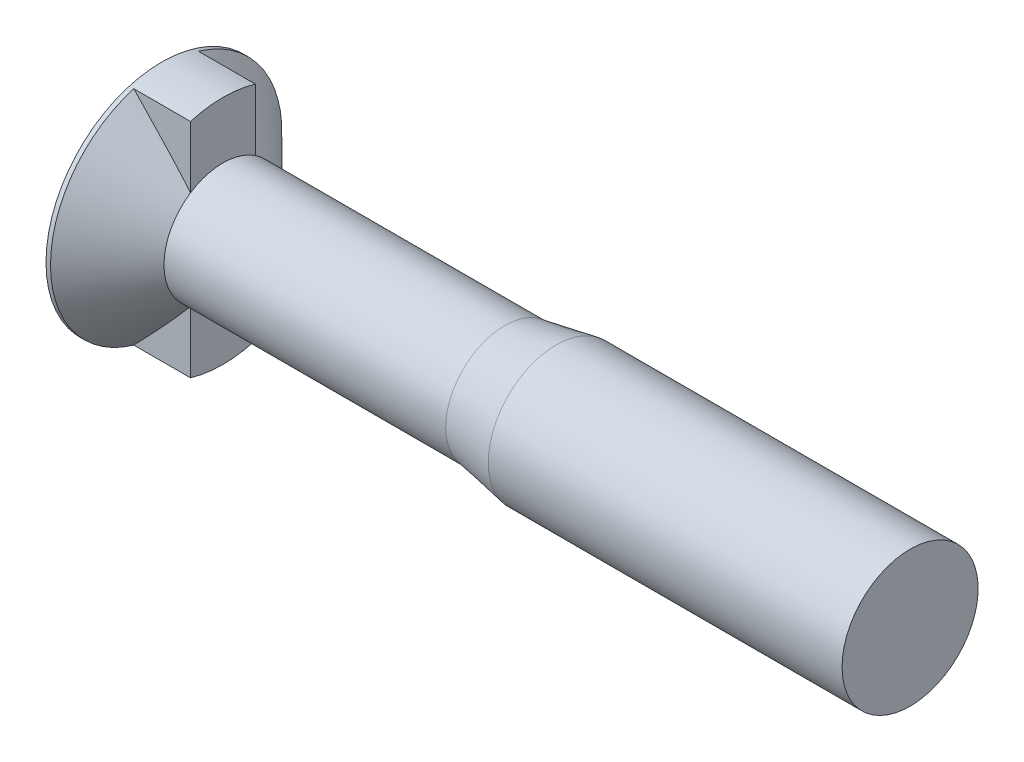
ISO-10303-21;
HEADER;
FILE_DESCRIPTION(('STEP AP214'),'2;1');
FILE_NAME('part.step','',(''),(''),'','','');
FILE_SCHEMA(('AUTOMOTIVE_DESIGN { 1 0 10303 214 1 1 1 1 }'));
ENDSEC;
DATA;
#1=APPLICATION_CONTEXT('core data for automotive mechanical design processes');
#2=APPLICATION_PROTOCOL_DEFINITION('international standard','automotive_design',2000,#1);
#3=PRODUCT_CONTEXT('',#1,'mechanical');
#4=PRODUCT('Part','Part','',(#3));
#5=PRODUCT_RELATED_PRODUCT_CATEGORY('part','',(#4));
#6=PRODUCT_DEFINITION_FORMATION('','',#4);
#7=PRODUCT_DEFINITION_CONTEXT('part definition',#1,'design');
#8=PRODUCT_DEFINITION('design','',#6,#7);
#9=PRODUCT_DEFINITION_SHAPE('','',#8);
#10=(LENGTH_UNIT() NAMED_UNIT(*) SI_UNIT(.MILLI.,.METRE.));
#11=(NAMED_UNIT(*) PLANE_ANGLE_UNIT() SI_UNIT($,.RADIAN.));
#12=(NAMED_UNIT(*) SI_UNIT($,.STERADIAN.) SOLID_ANGLE_UNIT());
#13=UNCERTAINTY_MEASURE_WITH_UNIT(LENGTH_MEASURE(1.E-05),#10,'distance_accuracy_value','');
#14=(GEOMETRIC_REPRESENTATION_CONTEXT(3) GLOBAL_UNCERTAINTY_ASSIGNED_CONTEXT((#13)) GLOBAL_UNIT_ASSIGNED_CONTEXT((#10,
#11,#12)) REPRESENTATION_CONTEXT('',''));
#15=CARTESIAN_POINT('',(0.,0.,0.));
#16=DIRECTION('',(0.,0.,1.));
#17=DIRECTION('',(1.,0.,0.));
#18=AXIS2_PLACEMENT_3D('',#15,#16,#17);
#19=CARTESIAN_POINT('',(0.,0.,0.));
#20=DIRECTION('',(1.,0.,0.));
#21=DIRECTION('',(0.,0.,-1.));
#22=AXIS2_PLACEMENT_3D('',#19,#20,#21);
#23=PLANE('',#22);
#24=CARTESIAN_POINT('',(0.,0.,0.));
#25=DIRECTION('',(-1.,0.,0.));
#26=DIRECTION('',(0.,0.,1.));
#27=AXIS2_PLACEMENT_3D('',#24,#25,#26);
#28=CIRCLE('',#27,8.5);
#29=CARTESIAN_POINT('',(0.,0.,8.5));
#30=VERTEX_POINT('',#29);
#31=EDGE_CURVE('E183',#30,#30,#28,.T.);
#32=ORIENTED_EDGE('',*,*,#31,.T.);
#33=EDGE_LOOP('',(#32));
#34=FACE_BOUND('',#33,.T.);
#35=ADVANCED_FACE('F50',(#34),#23,.F.);
#36=CARTESIAN_POINT('',(0.,8.5,-2.38));
#37=DIRECTION('',(0.,0.,-1.));
#38=DIRECTION('',(-1.,0.,0.));
#39=AXIS2_PLACEMENT_3D('',#36,#37,#38);
#40=PLANE('',#39);
#41=CARTESIAN_POINT('',(-10.1726294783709,18.8529549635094,-2.38));
#42=CARTESIAN_POINT('',(-9.6092054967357,18.2850367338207,-2.38));
#43=CARTESIAN_POINT('',(-9.04596141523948,17.7169396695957,-2.38));
#44=CARTESIAN_POINT('',(-7.91985527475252,16.5800527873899,-2.38));
#45=CARTESIAN_POINT('',(-7.35699336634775,16.0112628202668,-2.38));
#46=CARTESIAN_POINT('',(-6.22887883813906,14.8698254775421,-2.38));
#47=CARTESIAN_POINT('',(-5.66363020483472,14.2971741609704,-2.38));
#48=CARTESIAN_POINT('',(-4.53431907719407,13.1510133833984,-2.38));
#49=CARTESIAN_POINT('',(-3.97025629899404,12.5775042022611,-2.38));
#50=CARTESIAN_POINT('',(-3.03724942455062,11.6263293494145,-2.38));
#51=CARTESIAN_POINT('',(-2.66786793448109,11.2490928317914,-2.38));
#52=CARTESIAN_POINT('',(-1.92998632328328,10.4937379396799,-2.38));
#53=CARTESIAN_POINT('',(-1.56148622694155,10.1156195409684,-2.38));
#54=CARTESIAN_POINT('',(-0.825369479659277,9.35783453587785,-2.38));
#55=CARTESIAN_POINT('',(-0.457753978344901,8.9781668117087,-2.38));
#56=CARTESIAN_POINT('',(0.275668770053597,8.21716306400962,-2.38));
#57=CARTESIAN_POINT('',(0.64147619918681,7.83582721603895,-2.38));
#58=CARTESIAN_POINT('',(1.36888609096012,7.07225438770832,-2.38));
#59=CARTESIAN_POINT('',(1.73049983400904,6.69002818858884,-2.38));
#60=CARTESIAN_POINT('',(2.26977755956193,6.11359862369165,-2.38));
#61=CARTESIAN_POINT('',(2.44904940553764,5.92090058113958,-2.38));
#62=CARTESIAN_POINT('',(2.80616129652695,5.53418944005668,-2.38));
#63=CARTESIAN_POINT('',(2.98400137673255,5.3401763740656,-2.38));
#64=CARTESIAN_POINT('',(3.33745954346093,4.95073902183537,-2.38));
#65=CARTESIAN_POINT('',(3.51308091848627,4.75531772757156,-2.38));
#66=CARTESIAN_POINT('',(3.86164672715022,4.36210942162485,-2.38));
#67=CARTESIAN_POINT('',(4.03459124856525,4.164322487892,-2.38));
#68=CARTESIAN_POINT('',(4.3765190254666,3.76554433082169,-2.38));
#69=CARTESIAN_POINT('',(4.54550471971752,3.56455521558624,-2.38));
#70=CARTESIAN_POINT('',(4.79449741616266,3.25943933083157,-2.38));
#71=CARTESIAN_POINT('',(4.87674005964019,3.15713814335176,-2.38));
#72=CARTESIAN_POINT('',(5.03931634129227,2.95103221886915,-2.38));
#73=CARTESIAN_POINT('',(5.11965009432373,2.84722757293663,-2.38));
#74=CARTESIAN_POINT('',(5.2236259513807,2.70955522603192,-2.38));
#75=CARTESIAN_POINT('',(5.24837985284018,2.67652552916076,-2.38));
#76=CARTESIAN_POINT('',(5.29762112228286,2.61026669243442,-2.38));
#77=CARTESIAN_POINT('',(5.32210848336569,2.57703754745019,-2.38));
#78=CARTESIAN_POINT('',(5.39513720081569,2.47702782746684,-2.38));
#79=CARTESIAN_POINT('',(5.44324290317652,2.40992798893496,-2.38));
#80=CARTESIAN_POINT('',(5.53809377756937,2.2747072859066,-2.38));
#81=CARTESIAN_POINT('',(5.58483807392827,2.20658580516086,-2.38));
#82=CARTESIAN_POINT('',(5.67663447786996,2.06921412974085,-2.38));
#83=CARTESIAN_POINT('',(5.7216866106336,1.99996395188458,-2.38));
#84=CARTESIAN_POINT('',(5.85288854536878,1.79169325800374,-2.38));
#85=CARTESIAN_POINT('',(5.93606939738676,1.65077298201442,-2.38));
#86=CARTESIAN_POINT('',(6.09028702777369,1.36242824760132,-2.38));
#87=CARTESIAN_POINT('',(6.16133932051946,1.2150124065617,-2.38));
#88=CARTESIAN_POINT('',(6.2528595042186,0.990684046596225,-2.38));
#89=CARTESIAN_POINT('',(6.28049350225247,0.916704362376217,-2.38));
#90=CARTESIAN_POINT('',(6.33043185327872,0.766951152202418,-2.38));
#91=CARTESIAN_POINT('',(6.35273683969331,0.691177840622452,-2.38));
#92=CARTESIAN_POINT('',(6.39093323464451,0.538400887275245,-2.38));
#93=CARTESIAN_POINT('',(6.40685537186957,0.461405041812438,-2.38));
#94=CARTESIAN_POINT('',(6.43155420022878,0.306262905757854,-2.38));
#95=CARTESIAN_POINT('',(6.44033159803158,0.228116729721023,-2.38));
#96=CARTESIAN_POINT('',(6.45022100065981,0.0705765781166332,-2.38));
#97=CARTESIAN_POINT('',(6.45125857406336,-0.00882217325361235,-2.38));
#98=CARTESIAN_POINT('',(6.44539842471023,-0.167320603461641,-2.38));
#99=CARTESIAN_POINT('',(6.43850061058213,-0.246420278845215,-2.38));
#100=CARTESIAN_POINT('',(6.41720013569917,-0.403867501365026,-2.38));
#101=CARTESIAN_POINT('',(6.40277120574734,-0.482211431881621,-2.38));
#102=CARTESIAN_POINT('',(6.36725131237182,-0.637363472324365,-2.38));
#103=CARTESIAN_POINT('',(6.34615877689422,-0.714171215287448,-2.38));
#104=CARTESIAN_POINT('',(6.28595939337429,-0.905253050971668,-2.38));
#105=CARTESIAN_POINT('',(6.24317723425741,-1.01836422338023,-2.38));
#106=CARTESIAN_POINT('',(6.14798214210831,-1.24043752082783,-2.38));
#107=CARTESIAN_POINT('',(6.09556167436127,-1.34939631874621,-2.38));
#108=CARTESIAN_POINT('',(5.98347801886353,-1.56411852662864,-2.38));
#109=CARTESIAN_POINT('',(5.92378264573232,-1.6698649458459,-2.38));
#110=CARTESIAN_POINT('',(5.83039345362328,-1.82612085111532,-2.38));
#111=CARTESIAN_POINT('',(5.79862852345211,-1.87780346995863,-2.38));
#112=CARTESIAN_POINT('',(5.73398399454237,-1.98046493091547,-2.38));
#113=CARTESIAN_POINT('',(5.70110444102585,-2.03144380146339,-2.38));
#114=CARTESIAN_POINT('',(5.58801863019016,-2.20320274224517,-2.38));
#115=CARTESIAN_POINT('',(5.50556046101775,-2.32250103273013,-2.38));
#116=CARTESIAN_POINT('',(5.33673628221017,-2.55831016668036,-2.38));
#117=CARTESIAN_POINT('',(5.25036939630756,-2.67482037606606,-2.38));
#118=CARTESIAN_POINT('',(5.07469403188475,-2.90572142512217,-2.38));
#119=CARTESIAN_POINT('',(4.98538356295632,-3.0201107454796,-2.38));
#120=CARTESIAN_POINT('',(4.80457659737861,-3.24715248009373,-2.38));
#121=CARTESIAN_POINT('',(4.71307997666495,-3.35980479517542,-2.38));
#122=CARTESIAN_POINT('',(4.52818158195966,-3.58397838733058,-2.38));
#123=CARTESIAN_POINT('',(4.43477582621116,-3.69549637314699,-2.38));
#124=CARTESIAN_POINT('',(4.24662353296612,-3.91739677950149,-2.38));
#125=CARTESIAN_POINT('',(4.15187697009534,-4.02777917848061,-2.38));
#126=CARTESIAN_POINT('',(3.86612318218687,-4.35744551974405,-2.38));
#127=CARTESIAN_POINT('',(3.67352071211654,-4.57534597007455,-2.38));
#128=CARTESIAN_POINT('',(3.28485887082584,-5.00929063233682,-2.38));
#129=CARTESIAN_POINT('',(3.08879039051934,-5.22532664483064,-2.38));
#130=CARTESIAN_POINT('',(2.69461493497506,-5.6555685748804,-2.38));
#131=CARTESIAN_POINT('',(2.49650775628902,-5.86977430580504,-2.38));
#132=CARTESIAN_POINT('',(2.09911620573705,-6.29649459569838,-2.38));
#133=CARTESIAN_POINT('',(1.89983402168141,-6.50901119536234,-2.38));
#134=CARTESIAN_POINT('',(1.50016920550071,-6.93299320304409,-2.38));
#135=CARTESIAN_POINT('',(1.29978660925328,-7.14445864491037,-2.38));
#136=CARTESIAN_POINT('',(0.865817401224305,-7.60058061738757,-2.38));
#137=CARTESIAN_POINT('',(0.632082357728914,-7.84509584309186,-2.38));
#138=CARTESIAN_POINT('',(0.163737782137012,-8.33328768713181,-2.38));
#139=CARTESIAN_POINT('',(-0.0708717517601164,-8.57696430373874,-2.38));
#140=CARTESIAN_POINT('',(-0.775716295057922,-9.30702865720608,-2.38));
#141=CARTESIAN_POINT('',(-1.24695949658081,-9.79244278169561,-2.38));
#142=CARTESIAN_POINT('',(-2.1914508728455,-10.7619176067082,-2.38));
#143=CARTESIAN_POINT('',(-2.66470013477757,-11.245977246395,-2.38));
#144=CARTESIAN_POINT('',(-3.61236167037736,-12.2129497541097,-2.38));
#145=CARTESIAN_POINT('',(-4.08677393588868,-12.6958626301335,-2.38));
#146=CARTESIAN_POINT('',(-5.02821473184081,-13.652531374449,-2.38));
#147=CARTESIAN_POINT('',(-5.49522909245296,-14.1263011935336,-2.38));
#148=CARTESIAN_POINT('',(-6.42985007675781,-15.0732583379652,-2.38));
#149=CARTESIAN_POINT('',(-6.89745670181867,-15.5464456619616,-2.38));
#150=CARTESIAN_POINT('',(-7.83279377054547,-16.4920501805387,-2.38));
#151=CARTESIAN_POINT('',(-8.30052390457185,-16.9644676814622,-2.38));
#152=CARTESIAN_POINT('',(-9.236335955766,-17.9089513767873,-2.38));
#153=CARTESIAN_POINT('',(-9.70441787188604,-18.3810175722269,-2.38));
#154=CARTESIAN_POINT('',(-10.1726294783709,-18.8529549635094,-2.38));
#155=B_SPLINE_CURVE_WITH_KNOTS('',3,(#41,#42,#43,#44,#45,#46,#47,#48,#49,#50,#51,#52,#53,#54,
#55,#56,#57,#58,#59,#60,#61,#62,#63,#64,#65,#66,#67,#68,#69,#70,#71,#72,#73,#74,#75,#76,#77,#78,
#79,#80,#81,#82,#83,#84,#85,#86,#87,#88,#89,#90,#91,#92,#93,#94,#95,#96,#97,#98,#99,#100,#101,
#102,#103,#104,#105,#106,#107,#108,#109,#110,#111,#112,#113,#114,#115,#116,#117,#118,#119,#120,
#121,#122,#123,#124,#125,#126,#127,#128,#129,#130,#131,#132,#133,#134,#135,#136,#137,#138,#139,
#140,#141,#142,#143,#144,#145,#146,#147,#148,#149,#150,#151,#152,#153,#154),.UNSPECIFIED.,.F.,
.F.,(4,2,2,2,2,2,2,2,2,2,2,2,2,2,2,2,2,2,2,2,2,2,2,2,2,2,2,2,2,2,2,2,2,2,2,2,2,2,2,2,2,2,2,2,2,
2,2,2,2,2,2,2,2,2,2,2,4),(0.,2.39995853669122,4.80058720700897,7.21448779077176,
9.62772338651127,11.2116259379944,12.7955725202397,14.381001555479,15.9662675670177,
17.5447719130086,18.3343477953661,19.1239042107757,19.9121061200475,20.7002821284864,
21.4879590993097,21.8817259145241,22.2754689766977,22.39929620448,22.5231266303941,
22.7707988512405,23.0186270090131,23.2664514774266,23.7570210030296,24.2469582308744,
24.4837150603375,24.7204437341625,24.9560186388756,25.1915702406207,25.4293841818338,
25.6672008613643,25.9058526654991,26.1445608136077,26.5066990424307,26.8691215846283,
27.2332100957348,27.4151914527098,27.5971654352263,28.0321064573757,28.4671454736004,
28.9024849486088,29.3378491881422,29.7742394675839,30.21063801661,31.083054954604,
31.9582711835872,32.833575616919,33.7075788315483,34.581553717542,35.5963305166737,
36.6111094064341,38.640700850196,40.6715869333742,42.7024588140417,44.6982142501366,
46.6939743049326,48.6883531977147,50.6827261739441),.UNSPECIFIED.);
#156=CARTESIAN_POINT('',(0.329957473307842,8.16,-2.38));
#157=VERTEX_POINT('',#156);
#158=CARTESIAN_POINT('',(4.5,3.61719943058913,-2.38));
#159=VERTEX_POINT('',#158);
#160=EDGE_CURVE('E124',#157,#159,#155,.T.);
#161=ORIENTED_EDGE('',*,*,#160,.F.);
#162=DIRECTION('',(-1.,0.,0.));
#163=VECTOR('',#162,1.);
#164=CARTESIAN_POINT('',(55.,8.16,-2.38));
#165=LINE('',#164,#163);
#166=CARTESIAN_POINT('',(4.5,8.16,-2.38));
#167=VERTEX_POINT('',#166);
#168=EDGE_CURVE('E113',#157,#167,#165,.F.);
#169=ORIENTED_EDGE('',*,*,#168,.T.);
#170=DIRECTION('',(0.,1.,0.));
#171=VECTOR('',#170,1.);
#172=CARTESIAN_POINT('',(4.5,8.5,-2.38));
#173=LINE('',#172,#171);
#174=EDGE_CURVE('E134',#159,#167,#173,.T.);
#175=ORIENTED_EDGE('',*,*,#174,.F.);
#176=EDGE_LOOP('',(#161,#169,#175));
#177=FACE_BOUND('',#176,.T.);
#178=ADVANCED_FACE('F151',(#177),#40,.T.);
#179=CARTESIAN_POINT('',(0.,8.5,2.38));
#180=DIRECTION('',(0.,0.,-1.));
#181=DIRECTION('',(-1.,0.,0.));
#182=AXIS2_PLACEMENT_3D('',#179,#180,#181);
#183=PLANE('',#182);
#184=DIRECTION('',(-1.,0.,0.));
#185=VECTOR('',#184,1.);
#186=CARTESIAN_POINT('',(55.,8.16,2.38));
#187=LINE('',#186,#185);
#188=CARTESIAN_POINT('',(0.329957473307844,8.16,2.38));
#189=VERTEX_POINT('',#188);
#190=CARTESIAN_POINT('',(4.5,8.16,2.38));
#191=VERTEX_POINT('',#190);
#192=EDGE_CURVE('E119',#189,#191,#187,.F.);
#193=ORIENTED_EDGE('',*,*,#192,.F.);
#194=CARTESIAN_POINT('',(-10.1726294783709,18.8529549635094,2.38));
#195=CARTESIAN_POINT('',(-9.6092054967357,18.2850367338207,2.38));
#196=CARTESIAN_POINT('',(-9.04596141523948,17.7169396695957,2.38));
#197=CARTESIAN_POINT('',(-7.91985527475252,16.5800527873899,2.38));
#198=CARTESIAN_POINT('',(-7.35699336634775,16.0112628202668,2.38));
#199=CARTESIAN_POINT('',(-6.22887883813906,14.8698254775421,2.38));
#200=CARTESIAN_POINT('',(-5.66363020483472,14.2971741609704,2.38));
#201=CARTESIAN_POINT('',(-4.53431907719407,13.1510133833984,2.38));
#202=CARTESIAN_POINT('',(-3.97025629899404,12.5775042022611,2.38));
#203=CARTESIAN_POINT('',(-3.03724942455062,11.6263293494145,2.38));
#204=CARTESIAN_POINT('',(-2.66786793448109,11.2490928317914,2.38));
#205=CARTESIAN_POINT('',(-1.92998632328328,10.4937379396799,2.38));
#206=CARTESIAN_POINT('',(-1.56148622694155,10.1156195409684,2.38));
#207=CARTESIAN_POINT('',(-0.825369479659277,9.35783453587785,2.38));
#208=CARTESIAN_POINT('',(-0.457753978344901,8.9781668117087,2.38));
#209=CARTESIAN_POINT('',(0.275668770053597,8.21716306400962,2.38));
#210=CARTESIAN_POINT('',(0.64147619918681,7.83582721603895,2.38));
#211=CARTESIAN_POINT('',(1.36888609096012,7.07225438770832,2.38));
#212=CARTESIAN_POINT('',(1.73049983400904,6.69002818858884,2.38));
#213=CARTESIAN_POINT('',(2.26977755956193,6.11359862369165,2.38));
#214=CARTESIAN_POINT('',(2.44904940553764,5.92090058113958,2.38));
#215=CARTESIAN_POINT('',(2.80616129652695,5.53418944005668,2.38));
#216=CARTESIAN_POINT('',(2.98400137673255,5.3401763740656,2.38));
#217=CARTESIAN_POINT('',(3.33745954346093,4.95073902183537,2.38));
#218=CARTESIAN_POINT('',(3.51308091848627,4.75531772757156,2.38));
#219=CARTESIAN_POINT('',(3.86164672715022,4.36210942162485,2.38));
#220=CARTESIAN_POINT('',(4.03459124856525,4.164322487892,2.38));
#221=CARTESIAN_POINT('',(4.3765190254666,3.76554433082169,2.38));
#222=CARTESIAN_POINT('',(4.54550471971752,3.56455521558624,2.38));
#223=CARTESIAN_POINT('',(4.79449741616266,3.25943933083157,2.38));
#224=CARTESIAN_POINT('',(4.87674005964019,3.15713814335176,2.38));
#225=CARTESIAN_POINT('',(5.03931634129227,2.95103221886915,2.38));
#226=CARTESIAN_POINT('',(5.11965009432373,2.84722757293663,2.38));
#227=CARTESIAN_POINT('',(5.2236259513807,2.70955522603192,2.38));
#228=CARTESIAN_POINT('',(5.24837985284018,2.67652552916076,2.38));
#229=CARTESIAN_POINT('',(5.29762112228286,2.61026669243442,2.38));
#230=CARTESIAN_POINT('',(5.32210848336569,2.57703754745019,2.38));
#231=CARTESIAN_POINT('',(5.39513720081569,2.47702782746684,2.38));
#232=CARTESIAN_POINT('',(5.44324290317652,2.40992798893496,2.38));
#233=CARTESIAN_POINT('',(5.53809377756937,2.2747072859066,2.38));
#234=CARTESIAN_POINT('',(5.58483807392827,2.20658580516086,2.38));
#235=CARTESIAN_POINT('',(5.67663447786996,2.06921412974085,2.38));
#236=CARTESIAN_POINT('',(5.7216866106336,1.99996395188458,2.38));
#237=CARTESIAN_POINT('',(5.85288854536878,1.79169325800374,2.38));
#238=CARTESIAN_POINT('',(5.93606939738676,1.65077298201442,2.38));
#239=CARTESIAN_POINT('',(6.09028702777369,1.36242824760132,2.38));
#240=CARTESIAN_POINT('',(6.16133932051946,1.2150124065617,2.38));
#241=CARTESIAN_POINT('',(6.2528595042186,0.990684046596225,2.38));
#242=CARTESIAN_POINT('',(6.28049350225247,0.916704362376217,2.38));
#243=CARTESIAN_POINT('',(6.33043185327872,0.766951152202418,2.38));
#244=CARTESIAN_POINT('',(6.35273683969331,0.691177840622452,2.38));
#245=CARTESIAN_POINT('',(6.39093323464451,0.538400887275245,2.38));
#246=CARTESIAN_POINT('',(6.40685537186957,0.461405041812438,2.38));
#247=CARTESIAN_POINT('',(6.43155420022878,0.306262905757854,2.38));
#248=CARTESIAN_POINT('',(6.44033159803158,0.228116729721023,2.38));
#249=CARTESIAN_POINT('',(6.45022100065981,0.0705765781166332,2.38));
#250=CARTESIAN_POINT('',(6.45125857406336,-0.00882217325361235,2.38));
#251=CARTESIAN_POINT('',(6.44539842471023,-0.167320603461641,2.38));
#252=CARTESIAN_POINT('',(6.43850061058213,-0.246420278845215,2.38));
#253=CARTESIAN_POINT('',(6.41720013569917,-0.403867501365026,2.38));
#254=CARTESIAN_POINT('',(6.40277120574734,-0.482211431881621,2.38));
#255=CARTESIAN_POINT('',(6.36725131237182,-0.637363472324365,2.38));
#256=CARTESIAN_POINT('',(6.34615877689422,-0.714171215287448,2.38));
#257=CARTESIAN_POINT('',(6.28595939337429,-0.905253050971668,2.38));
#258=CARTESIAN_POINT('',(6.24317723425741,-1.01836422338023,2.38));
#259=CARTESIAN_POINT('',(6.14798214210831,-1.24043752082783,2.38));
#260=CARTESIAN_POINT('',(6.09556167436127,-1.34939631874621,2.38));
#261=CARTESIAN_POINT('',(5.98347801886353,-1.56411852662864,2.38));
#262=CARTESIAN_POINT('',(5.92378264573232,-1.6698649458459,2.38));
#263=CARTESIAN_POINT('',(5.83039345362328,-1.82612085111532,2.38));
#264=CARTESIAN_POINT('',(5.79862852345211,-1.87780346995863,2.38));
#265=CARTESIAN_POINT('',(5.73398399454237,-1.98046493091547,2.38));
#266=CARTESIAN_POINT('',(5.70110444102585,-2.03144380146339,2.38));
#267=CARTESIAN_POINT('',(5.58801863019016,-2.20320274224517,2.38));
#268=CARTESIAN_POINT('',(5.50556046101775,-2.32250103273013,2.38));
#269=CARTESIAN_POINT('',(5.33673628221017,-2.55831016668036,2.38));
#270=CARTESIAN_POINT('',(5.25036939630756,-2.67482037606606,2.38));
#271=CARTESIAN_POINT('',(5.07469403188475,-2.90572142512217,2.38));
#272=CARTESIAN_POINT('',(4.98538356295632,-3.0201107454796,2.38));
#273=CARTESIAN_POINT('',(4.80457659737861,-3.24715248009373,2.38));
#274=CARTESIAN_POINT('',(4.71307997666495,-3.35980479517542,2.38));
#275=CARTESIAN_POINT('',(4.52818158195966,-3.58397838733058,2.38));
#276=CARTESIAN_POINT('',(4.43477582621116,-3.69549637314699,2.38));
#277=CARTESIAN_POINT('',(4.24662353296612,-3.91739677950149,2.38));
#278=CARTESIAN_POINT('',(4.15187697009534,-4.02777917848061,2.38));
#279=CARTESIAN_POINT('',(3.86612318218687,-4.35744551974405,2.38));
#280=CARTESIAN_POINT('',(3.67352071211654,-4.57534597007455,2.38));
#281=CARTESIAN_POINT('',(3.28485887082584,-5.00929063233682,2.38));
#282=CARTESIAN_POINT('',(3.08879039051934,-5.22532664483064,2.38));
#283=CARTESIAN_POINT('',(2.69461493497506,-5.6555685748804,2.38));
#284=CARTESIAN_POINT('',(2.49650775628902,-5.86977430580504,2.38));
#285=CARTESIAN_POINT('',(2.09911620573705,-6.29649459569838,2.38));
#286=CARTESIAN_POINT('',(1.89983402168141,-6.50901119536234,2.38));
#287=CARTESIAN_POINT('',(1.50016920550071,-6.93299320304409,2.38));
#288=CARTESIAN_POINT('',(1.29978660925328,-7.14445864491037,2.38));
#289=CARTESIAN_POINT('',(0.865817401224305,-7.60058061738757,2.38));
#290=CARTESIAN_POINT('',(0.632082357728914,-7.84509584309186,2.38));
#291=CARTESIAN_POINT('',(0.163737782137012,-8.33328768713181,2.38));
#292=CARTESIAN_POINT('',(-0.0708717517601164,-8.57696430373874,2.38));
#293=CARTESIAN_POINT('',(-0.775716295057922,-9.30702865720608,2.38));
#294=CARTESIAN_POINT('',(-1.24695949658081,-9.79244278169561,2.38));
#295=CARTESIAN_POINT('',(-2.1914508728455,-10.7619176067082,2.38));
#296=CARTESIAN_POINT('',(-2.66470013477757,-11.245977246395,2.38));
#297=CARTESIAN_POINT('',(-3.61236167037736,-12.2129497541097,2.38));
#298=CARTESIAN_POINT('',(-4.08677393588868,-12.6958626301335,2.38));
#299=CARTESIAN_POINT('',(-5.02821473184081,-13.652531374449,2.38));
#300=CARTESIAN_POINT('',(-5.49522909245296,-14.1263011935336,2.38));
#301=CARTESIAN_POINT('',(-6.42985007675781,-15.0732583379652,2.38));
#302=CARTESIAN_POINT('',(-6.89745670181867,-15.5464456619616,2.38));
#303=CARTESIAN_POINT('',(-7.83279377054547,-16.4920501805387,2.38));
#304=CARTESIAN_POINT('',(-8.30052390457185,-16.9644676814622,2.38));
#305=CARTESIAN_POINT('',(-9.236335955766,-17.9089513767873,2.38));
#306=CARTESIAN_POINT('',(-9.70441787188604,-18.3810175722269,2.38));
#307=CARTESIAN_POINT('',(-10.1726294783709,-18.8529549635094,2.38));
#308=B_SPLINE_CURVE_WITH_KNOTS('',3,(#194,#195,#196,#197,#198,#199,#200,#201,#202,#203,#204,
#205,#206,#207,#208,#209,#210,#211,#212,#213,#214,#215,#216,#217,#218,#219,#220,#221,#222,#223,
#224,#225,#226,#227,#228,#229,#230,#231,#232,#233,#234,#235,#236,#237,#238,#239,#240,#241,#242,
#243,#244,#245,#246,#247,#248,#249,#250,#251,#252,#253,#254,#255,#256,#257,#258,#259,#260,#261,
#262,#263,#264,#265,#266,#267,#268,#269,#270,#271,#272,#273,#274,#275,#276,#277,#278,#279,#280,
#281,#282,#283,#284,#285,#286,#287,#288,#289,#290,#291,#292,#293,#294,#295,#296,#297,#298,#299,
#300,#301,#302,#303,#304,#305,#306,#307),.UNSPECIFIED.,.F.,.F.,(4,2,2,2,2,2,2,2,2,2,2,2,2,2,2,2,
2,2,2,2,2,2,2,2,2,2,2,2,2,2,2,2,2,2,2,2,2,2,2,2,2,2,2,2,2,2,2,2,2,2,2,2,2,2,2,2,4),(0.,
2.39995853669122,4.80058720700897,7.21448779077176,9.62772338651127,11.2116259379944,
12.7955725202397,14.381001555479,15.9662675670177,17.5447719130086,18.3343477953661,
19.1239042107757,19.9121061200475,20.7002821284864,21.4879590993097,21.8817259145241,
22.2754689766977,22.39929620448,22.5231266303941,22.7707988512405,23.0186270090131,
23.2664514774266,23.7570210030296,24.2469582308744,24.4837150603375,24.7204437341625,
24.9560186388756,25.1915702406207,25.4293841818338,25.6672008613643,25.9058526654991,
26.1445608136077,26.5066990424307,26.8691215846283,27.2332100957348,27.4151914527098,
27.5971654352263,28.0321064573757,28.4671454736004,28.9024849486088,29.3378491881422,
29.7742394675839,30.21063801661,31.083054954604,31.9582711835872,32.833575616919,
33.7075788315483,34.581553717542,35.5963305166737,36.6111094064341,38.640700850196,
40.6715869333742,42.7024588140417,44.6982142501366,46.6939743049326,48.6883531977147,
50.6827261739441),.UNSPECIFIED.);
#309=CARTESIAN_POINT('',(4.5,3.61719943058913,2.38));
#310=VERTEX_POINT('',#309);
#311=EDGE_CURVE('E65',#189,#310,#308,.T.);
#312=ORIENTED_EDGE('',*,*,#311,.T.);
#313=DIRECTION('',(0.,1.,0.));
#314=VECTOR('',#313,1.);
#315=CARTESIAN_POINT('',(4.5,8.5,2.38));
#316=LINE('',#315,#314);
#317=EDGE_CURVE('E125',#310,#191,#316,.T.);
#318=ORIENTED_EDGE('',*,*,#317,.T.);
#319=EDGE_LOOP('',(#193,#312,#318));
#320=FACE_BOUND('',#319,.T.);
#321=ADVANCED_FACE('F155',(#320),#183,.F.);
#322=CARTESIAN_POINT('',(4.5,8.5,2.38));
#323=DIRECTION('',(-1.,0.,0.));
#324=DIRECTION('',(0.,0.,1.));
#325=AXIS2_PLACEMENT_3D('',#322,#323,#324);
#326=PLANE('',#325);
#327=CARTESIAN_POINT('',(4.5,0.,0.));
#328=DIRECTION('',(-1.,0.,0.));
#329=DIRECTION('',(0.,0.,1.));
#330=AXIS2_PLACEMENT_3D('',#327,#328,#329);
#331=CIRCLE('',#330,8.5);
#332=EDGE_CURVE('E228',#191,#167,#331,.T.);
#333=ORIENTED_EDGE('',*,*,#332,.F.);
#334=ORIENTED_EDGE('',*,*,#317,.F.);
#335=CARTESIAN_POINT('',(4.5,0.,0.));
#336=DIRECTION('',(-1.,0.,0.));
#337=DIRECTION('',(0.,0.,1.));
#338=AXIS2_PLACEMENT_3D('',#335,#336,#337);
#339=CIRCLE('',#338,4.32995747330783);
#340=EDGE_CURVE('E58',#310,#159,#339,.T.);
#341=ORIENTED_EDGE('',*,*,#340,.T.);
#342=ORIENTED_EDGE('',*,*,#174,.T.);
#343=EDGE_LOOP('',(#333,#334,#341,#342));
#344=FACE_BOUND('',#343,.T.);
#345=ADVANCED_FACE('F159',(#344),#326,.F.);
#346=CARTESIAN_POINT('',(4.5,0.,0.));
#347=DIRECTION('',(-1.,0.,0.));
#348=DIRECTION('',(0.,0.,1.));
#349=AXIS2_PLACEMENT_3D('',#346,#347,#348);
#350=CIRCLE('',#349,8.5);
#351=CARTESIAN_POINT('',(4.5,-8.16,-2.38));
#352=VERTEX_POINT('',#351);
#353=CARTESIAN_POINT('',(4.5,-8.16,2.38));
#354=VERTEX_POINT('',#353);
#355=EDGE_CURVE('E105',#352,#354,#350,.T.);
#356=ORIENTED_EDGE('',*,*,#355,.F.);
#357=CARTESIAN_POINT('',(4.5,-3.61719943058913,-2.38));
#358=VERTEX_POINT('',#357);
#359=EDGE_CURVE('E130',#352,#358,#173,.T.);
#360=ORIENTED_EDGE('',*,*,#359,.T.);
#361=CARTESIAN_POINT('',(4.5,-3.61719943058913,2.38));
#362=VERTEX_POINT('',#361);
#363=EDGE_CURVE('E123',#358,#362,#339,.T.);
#364=ORIENTED_EDGE('',*,*,#363,.T.);
#365=EDGE_CURVE('E73',#354,#362,#316,.T.);
#366=ORIENTED_EDGE('',*,*,#365,.F.);
#367=EDGE_LOOP('',(#356,#360,#364,#366));
#368=FACE_BOUND('',#367,.T.);
#369=ADVANCED_FACE('F121',(#368),#326,.F.);
#370=DIRECTION('',(-1.,0.,0.));
#371=VECTOR('',#370,1.);
#372=CARTESIAN_POINT('',(55.,-8.16,2.38));
#373=LINE('',#372,#371);
#374=CARTESIAN_POINT('',(0.329957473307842,-8.16,2.38));
#375=VERTEX_POINT('',#374);
#376=EDGE_CURVE('E109',#354,#375,#373,.T.);
#377=ORIENTED_EDGE('',*,*,#376,.F.);
#378=ORIENTED_EDGE('',*,*,#365,.T.);
#379=EDGE_CURVE('E117',#362,#375,#308,.T.);
#380=ORIENTED_EDGE('',*,*,#379,.T.);
#381=EDGE_LOOP('',(#377,#378,#380));
#382=FACE_BOUND('',#381,.T.);
#383=ADVANCED_FACE('F115',(#382),#183,.F.);
#384=ORIENTED_EDGE('',*,*,#359,.F.);
#385=DIRECTION('',(-1.,0.,0.));
#386=VECTOR('',#385,1.);
#387=CARTESIAN_POINT('',(55.,-8.16,-2.38));
#388=LINE('',#387,#386);
#389=CARTESIAN_POINT('',(0.329957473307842,-8.16,-2.38));
#390=VERTEX_POINT('',#389);
#391=EDGE_CURVE('E110',#352,#390,#388,.T.);
#392=ORIENTED_EDGE('',*,*,#391,.T.);
#393=EDGE_CURVE('E128',#358,#390,#155,.T.);
#394=ORIENTED_EDGE('',*,*,#393,.F.);
#395=EDGE_LOOP('',(#384,#392,#394));
#396=FACE_BOUND('',#395,.T.);
#397=ADVANCED_FACE('F157',(#396),#40,.T.);
#398=CARTESIAN_POINT('',(4.5,0.,0.));
#399=DIRECTION('',(-1.,0.,0.));
#400=DIRECTION('',(0.,0.,1.));
#401=AXIS2_PLACEMENT_3D('',#398,#399,#400);
#402=CONICAL_SURFACE('',#401,4.32995747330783,0.78539816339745);
#403=ORIENTED_EDGE('',*,*,#311,.F.);
#404=CARTESIAN_POINT('',(0.329957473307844,0.,0.));
#405=DIRECTION('',(-1.,0.,0.));
#406=DIRECTION('',(0.,0.,1.));
#407=AXIS2_PLACEMENT_3D('',#404,#405,#406);
#408=CIRCLE('',#407,8.5);
#409=EDGE_CURVE('E184',#375,#189,#408,.T.);
#410=ORIENTED_EDGE('',*,*,#409,.F.);
#411=ORIENTED_EDGE('',*,*,#379,.F.);
#412=EDGE_CURVE('E193',#362,#310,#339,.T.);
#413=ORIENTED_EDGE('',*,*,#412,.T.);
#414=EDGE_LOOP('',(#403,#410,#411,#413));
#415=FACE_BOUND('',#414,.T.);
#416=ADVANCED_FACE('F180',(#415),#402,.T.);
#417=CARTESIAN_POINT('',(29.,0.,0.));
#418=DIRECTION('',(1.,0.,0.));
#419=DIRECTION('',(0.,0.,-1.));
#420=AXIS2_PLACEMENT_3D('',#417,#418,#419);
#421=CONICAL_SURFACE('',#420,5.,0.174532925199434);
#422=CARTESIAN_POINT('',(25.2,0.,0.));
#423=DIRECTION('',(-1.,0.,0.));
#424=DIRECTION('',(0.,0.,1.));
#425=AXIS2_PLACEMENT_3D('',#422,#423,#424);
#426=CIRCLE('',#425,4.32995747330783);
#427=CARTESIAN_POINT('',(25.2,0.,4.32995747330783));
#428=VERTEX_POINT('',#427);
#429=EDGE_CURVE('E13',#428,#428,#426,.T.);
#430=ORIENTED_EDGE('',*,*,#429,.F.);
#431=EDGE_LOOP('',(#430));
#432=FACE_BOUND('',#431,.T.);
#433=CARTESIAN_POINT('',(29.,0.,0.));
#434=DIRECTION('',(-1.,0.,0.));
#435=DIRECTION('',(0.,0.,1.));
#436=AXIS2_PLACEMENT_3D('',#433,#434,#435);
#437=CIRCLE('',#436,5.);
#438=CARTESIAN_POINT('',(29.,0.,5.));
#439=VERTEX_POINT('',#438);
#440=EDGE_CURVE('E190',#439,#439,#437,.T.);
#441=ORIENTED_EDGE('',*,*,#440,.T.);
#442=EDGE_LOOP('',(#441));
#443=FACE_BOUND('',#442,.T.);
#444=ADVANCED_FACE('F52',(#432,#443),#421,.T.);
#445=CARTESIAN_POINT('',(-4.94054877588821,0.,0.));
#446=DIRECTION('',(-1.,0.,0.));
#447=DIRECTION('',(0.,0.,1.));
#448=AXIS2_PLACEMENT_3D('',#445,#446,#447);
#449=CYLINDRICAL_SURFACE('',#448,4.32995747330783);
#450=ORIENTED_EDGE('',*,*,#340,.F.);
#451=ORIENTED_EDGE('',*,*,#412,.F.);
#452=ORIENTED_EDGE('',*,*,#363,.F.);
#453=EDGE_CURVE('E192',#159,#358,#339,.T.);
#454=ORIENTED_EDGE('',*,*,#453,.F.);
#455=EDGE_LOOP('',(#450,#451,#452,#454));
#456=FACE_BOUND('',#455,.T.);
#457=ORIENTED_EDGE('',*,*,#429,.T.);
#458=EDGE_LOOP('',(#457));
#459=FACE_BOUND('',#458,.T.);
#460=ADVANCED_FACE('F178',(#456,#459),#449,.T.);
#461=EDGE_CURVE('E187',#157,#390,#408,.T.);
#462=ORIENTED_EDGE('',*,*,#461,.F.);
#463=ORIENTED_EDGE('',*,*,#160,.T.);
#464=ORIENTED_EDGE('',*,*,#453,.T.);
#465=ORIENTED_EDGE('',*,*,#393,.T.);
#466=EDGE_LOOP('',(#462,#463,#464,#465));
#467=FACE_BOUND('',#466,.T.);
#468=ADVANCED_FACE('F148',(#467),#402,.T.);
#469=CARTESIAN_POINT('',(-4.94054877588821,0.,0.));
#470=DIRECTION('',(-1.,0.,0.));
#471=DIRECTION('',(0.,0.,1.));
#472=AXIS2_PLACEMENT_3D('',#469,#470,#471);
#473=CYLINDRICAL_SURFACE('',#472,8.5);
#474=ORIENTED_EDGE('',*,*,#31,.F.);
#475=EDGE_LOOP('',(#474));
#476=FACE_BOUND('',#475,.T.);
#477=ORIENTED_EDGE('',*,*,#461,.T.);
#478=ORIENTED_EDGE('',*,*,#391,.F.);
#479=ORIENTED_EDGE('',*,*,#355,.T.);
#480=ORIENTED_EDGE('',*,*,#376,.T.);
#481=ORIENTED_EDGE('',*,*,#409,.T.);
#482=ORIENTED_EDGE('',*,*,#192,.T.);
#483=ORIENTED_EDGE('',*,*,#332,.T.);
#484=ORIENTED_EDGE('',*,*,#168,.F.);
#485=EDGE_LOOP('',(#477,#478,#479,#480,#481,#482,#483,#484));
#486=FACE_BOUND('',#485,.T.);
#487=ADVANCED_FACE('F107',(#476,#486),#473,.T.);
#488=CARTESIAN_POINT('',(55.,5.,0.));
#489=DIRECTION('',(-1.,0.,0.));
#490=DIRECTION('',(0.,0.,1.));
#491=AXIS2_PLACEMENT_3D('',#488,#489,#490);
#492=PLANE('',#491);
#493=CARTESIAN_POINT('',(55.,0.,0.));
#494=DIRECTION('',(-1.,0.,0.));
#495=DIRECTION('',(0.,0.,1.));
#496=AXIS2_PLACEMENT_3D('',#493,#494,#495);
#497=CIRCLE('',#496,5.);
#498=CARTESIAN_POINT('',(55.,0.,5.));
#499=VERTEX_POINT('',#498);
#500=EDGE_CURVE('E185',#499,#499,#497,.T.);
#501=ORIENTED_EDGE('',*,*,#500,.F.);
#502=EDGE_LOOP('',(#501));
#503=FACE_BOUND('',#502,.T.);
#504=ADVANCED_FACE('F166',(#503),#492,.F.);
#505=CARTESIAN_POINT('',(-4.94054877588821,0.,0.));
#506=DIRECTION('',(-1.,0.,0.));
#507=DIRECTION('',(0.,0.,1.));
#508=AXIS2_PLACEMENT_3D('',#505,#506,#507);
#509=CYLINDRICAL_SURFACE('',#508,5.);
#510=ORIENTED_EDGE('',*,*,#440,.F.);
#511=EDGE_LOOP('',(#510));
#512=FACE_BOUND('',#511,.T.);
#513=ORIENTED_EDGE('',*,*,#500,.T.);
#514=EDGE_LOOP('',(#513));
#515=FACE_BOUND('',#514,.T.);
#516=ADVANCED_FACE('F163',(#512,#515),#509,.T.);
#517=CLOSED_SHELL('',(#35,#178,#321,#345,#369,#383,#397,#416,#444,#460,#468,#487,#504,#516));
#518=MANIFOLD_SOLID_BREP('B2',#517);
#519=ADVANCED_BREP_SHAPE_REPRESENTATION('',(#18,#518),#14);
#520=SHAPE_DEFINITION_REPRESENTATION(#9,#519);
ENDSEC;
END-ISO-10303-21;
